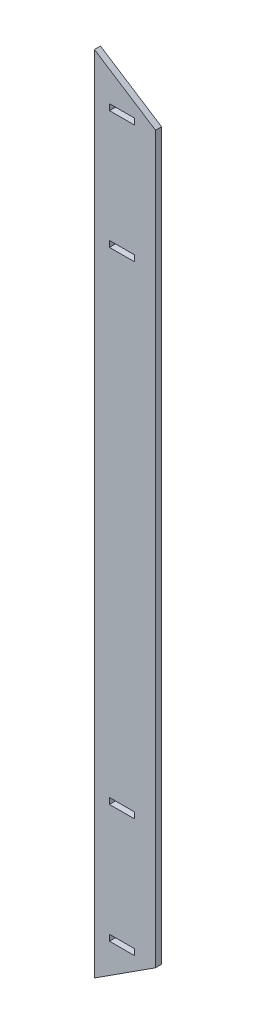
ISO-10303-21;
HEADER;
FILE_DESCRIPTION(('STEP AP214'),'2;1');
FILE_NAME('part.step','',(''),(''),'','','');
FILE_SCHEMA(('AUTOMOTIVE_DESIGN { 1 0 10303 214 1 1 1 1 }'));
ENDSEC;
DATA;
#1=APPLICATION_CONTEXT('core data for automotive mechanical design processes');
#2=APPLICATION_PROTOCOL_DEFINITION('international standard','automotive_design',2000,#1);
#3=PRODUCT_CONTEXT('',#1,'mechanical');
#4=PRODUCT('Part','Part','',(#3));
#5=PRODUCT_RELATED_PRODUCT_CATEGORY('part','',(#4));
#6=PRODUCT_DEFINITION_FORMATION('','',#4);
#7=PRODUCT_DEFINITION_CONTEXT('part definition',#1,'design');
#8=PRODUCT_DEFINITION('design','',#6,#7);
#9=PRODUCT_DEFINITION_SHAPE('','',#8);
#10=(LENGTH_UNIT() NAMED_UNIT(*) SI_UNIT(.MILLI.,.METRE.));
#11=(NAMED_UNIT(*) PLANE_ANGLE_UNIT() SI_UNIT($,.RADIAN.));
#12=(NAMED_UNIT(*) SI_UNIT($,.STERADIAN.) SOLID_ANGLE_UNIT());
#13=UNCERTAINTY_MEASURE_WITH_UNIT(LENGTH_MEASURE(1.E-05),#10,'distance_accuracy_value','');
#14=(GEOMETRIC_REPRESENTATION_CONTEXT(3) GLOBAL_UNCERTAINTY_ASSIGNED_CONTEXT((#13)) GLOBAL_UNIT_ASSIGNED_CONTEXT((#10,
#11,#12)) REPRESENTATION_CONTEXT('',''));
#15=CARTESIAN_POINT('',(0.,0.,0.));
#16=DIRECTION('',(0.,0.,1.));
#17=DIRECTION('',(1.,0.,0.));
#18=AXIS2_PLACEMENT_3D('',#15,#16,#17);
#19=CARTESIAN_POINT('',(0.,0.,1.524));
#20=DIRECTION('',(0.,0.,-1.));
#21=DIRECTION('',(-1.,0.,0.));
#22=AXIS2_PLACEMENT_3D('',#19,#20,#21);
#23=PLANE('',#22);
#24=DIRECTION('',(0.,-1.,0.));
#25=VECTOR('',#24,1.);
#26=CARTESIAN_POINT('',(5.31983445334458,-153.360857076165,1.524));
#27=LINE('',#26,#25);
#28=CARTESIAN_POINT('',(5.31983445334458,-151.836857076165,1.524));
#29=VERTEX_POINT('',#28);
#30=CARTESIAN_POINT('',(5.31983445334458,-153.360857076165,1.524));
#31=VERTEX_POINT('',#30);
#32=EDGE_CURVE('E209',#29,#31,#27,.T.);
#33=ORIENTED_EDGE('',*,*,#32,.F.);
#34=DIRECTION('',(-1.,0.,0.));
#35=VECTOR('',#34,1.);
#36=CARTESIAN_POINT('',(5.31983445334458,-151.836857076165,1.524));
#37=LINE('',#36,#35);
#38=CARTESIAN_POINT('',(11.6698344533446,-151.836857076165,1.524));
#39=VERTEX_POINT('',#38);
#40=EDGE_CURVE('E217',#39,#29,#37,.T.);
#41=ORIENTED_EDGE('',*,*,#40,.F.);
#42=DIRECTION('',(0.,1.,0.));
#43=VECTOR('',#42,1.);
#44=CARTESIAN_POINT('',(11.6698344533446,-153.360857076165,1.524));
#45=LINE('',#44,#43);
#46=CARTESIAN_POINT('',(11.6698344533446,-153.360857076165,1.524));
#47=VERTEX_POINT('',#46);
#48=EDGE_CURVE('E214',#47,#39,#45,.T.);
#49=ORIENTED_EDGE('',*,*,#48,.F.);
#50=DIRECTION('',(1.,0.,0.));
#51=VECTOR('',#50,1.);
#52=CARTESIAN_POINT('',(5.31983445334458,-153.360857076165,1.524));
#53=LINE('',#52,#51);
#54=EDGE_CURVE('E211',#31,#47,#53,.T.);
#55=ORIENTED_EDGE('',*,*,#54,.F.);
#56=EDGE_LOOP('',(#33,#41,#49,#55));
#57=FACE_BOUND('',#56,.T.);
#58=DIRECTION('',(0.,-1.,0.));
#59=VECTOR('',#58,1.);
#60=CARTESIAN_POINT('',(5.31983445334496,0.,1.524));
#61=LINE('',#60,#59);
#62=CARTESIAN_POINT('',(5.31983445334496,0.,1.524));
#63=VERTEX_POINT('',#62);
#64=CARTESIAN_POINT('',(5.31983445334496,-1.524,1.524));
#65=VERTEX_POINT('',#64);
#66=EDGE_CURVE('E271',#63,#65,#61,.T.);
#67=ORIENTED_EDGE('',*,*,#66,.F.);
#68=DIRECTION('',(-1.,0.,0.));
#69=VECTOR('',#68,1.);
#70=CARTESIAN_POINT('',(5.31983445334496,0.,1.524));
#71=LINE('',#70,#69);
#72=CARTESIAN_POINT('',(11.669834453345,0.,1.524));
#73=VERTEX_POINT('',#72);
#74=EDGE_CURVE('E279',#73,#63,#71,.T.);
#75=ORIENTED_EDGE('',*,*,#74,.F.);
#76=DIRECTION('',(0.,1.,0.));
#77=VECTOR('',#76,1.);
#78=CARTESIAN_POINT('',(11.669834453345,0.,1.524));
#79=LINE('',#78,#77);
#80=CARTESIAN_POINT('',(11.669834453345,-1.524,1.524));
#81=VERTEX_POINT('',#80);
#82=EDGE_CURVE('E276',#81,#73,#79,.T.);
#83=ORIENTED_EDGE('',*,*,#82,.F.);
#84=DIRECTION('',(1.,0.,0.));
#85=VECTOR('',#84,1.);
#86=CARTESIAN_POINT('',(5.31983445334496,-1.524,1.524));
#87=LINE('',#86,#85);
#88=EDGE_CURVE('E273',#65,#81,#87,.T.);
#89=ORIENTED_EDGE('',*,*,#88,.F.);
#90=EDGE_LOOP('',(#67,#75,#83,#89));
#91=FACE_BOUND('',#90,.T.);
#92=DIRECTION('',(-0.840540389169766,0.541748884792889,0.));
#93=VECTOR('',#92,1.);
#94=CARTESIAN_POINT('',(16.9701384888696,0.,1.524));
#95=LINE('',#94,#93);
#96=CARTESIAN_POINT('',(16.9701384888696,0.,1.524));
#97=VERTEX_POINT('',#96);
#98=CARTESIAN_POINT('',(1.52399999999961,9.9554148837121,1.524));
#99=VERTEX_POINT('',#98);
#100=EDGE_CURVE('E302',#97,#99,#95,.T.);
#101=ORIENTED_EDGE('',*,*,#100,.T.);
#102=DIRECTION('',(0.,-1.,0.));
#103=VECTOR('',#102,1.);
#104=CARTESIAN_POINT('',(1.52399999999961,9.9554148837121,1.524));
#105=LINE('',#104,#103);
#106=CARTESIAN_POINT('',(1.52399999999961,-193.244585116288,1.524));
#107=VERTEX_POINT('',#106);
#108=EDGE_CURVE('E305',#99,#107,#105,.T.);
#109=ORIENTED_EDGE('',*,*,#108,.T.);
#110=DIRECTION('',(0.840540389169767,0.541748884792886,0.));
#111=VECTOR('',#110,1.);
#112=CARTESIAN_POINT('',(1.52399999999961,-193.244585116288,1.524));
#113=LINE('',#112,#111);
#114=CARTESIAN_POINT('',(16.9701384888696,-183.289170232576,1.524));
#115=VERTEX_POINT('',#114);
#116=EDGE_CURVE('E308',#107,#115,#113,.T.);
#117=ORIENTED_EDGE('',*,*,#116,.T.);
#118=DIRECTION('',(0.,1.,0.));
#119=VECTOR('',#118,1.);
#120=CARTESIAN_POINT('',(16.9701384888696,-183.289170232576,1.524));
#121=LINE('',#120,#119);
#122=EDGE_CURVE('E310',#115,#97,#121,.T.);
#123=ORIENTED_EDGE('',*,*,#122,.T.);
#124=EDGE_LOOP('',(#101,#109,#117,#123));
#125=FACE_BOUND('',#124,.T.);
#126=DIRECTION('',(0.,-1.,0.));
#127=VECTOR('',#126,1.);
#128=CARTESIAN_POINT('',(5.31983445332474,-29.9283131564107,1.524));
#129=LINE('',#128,#127);
#130=CARTESIAN_POINT('',(5.31983445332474,-29.9283131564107,1.524));
#131=VERTEX_POINT('',#130);
#132=CARTESIAN_POINT('',(5.31983445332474,-31.4523131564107,1.524));
#133=VERTEX_POINT('',#132);
#134=EDGE_CURVE('E240',#131,#133,#129,.T.);
#135=ORIENTED_EDGE('',*,*,#134,.F.);
#136=DIRECTION('',(-1.,0.,0.));
#137=VECTOR('',#136,1.);
#138=CARTESIAN_POINT('',(5.31983445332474,-29.9283131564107,1.524));
#139=LINE('',#138,#137);
#140=CARTESIAN_POINT('',(11.6698344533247,-29.9283131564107,1.524));
#141=VERTEX_POINT('',#140);
#142=EDGE_CURVE('E248',#141,#131,#139,.T.);
#143=ORIENTED_EDGE('',*,*,#142,.F.);
#144=DIRECTION('',(0.,1.,0.));
#145=VECTOR('',#144,1.);
#146=CARTESIAN_POINT('',(11.6698344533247,-29.9283131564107,1.524));
#147=LINE('',#146,#145);
#148=CARTESIAN_POINT('',(11.6698344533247,-31.4523131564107,1.524));
#149=VERTEX_POINT('',#148);
#150=EDGE_CURVE('E245',#149,#141,#147,.T.);
#151=ORIENTED_EDGE('',*,*,#150,.F.);
#152=DIRECTION('',(1.,0.,0.));
#153=VECTOR('',#152,1.);
#154=CARTESIAN_POINT('',(5.31983445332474,-31.4523131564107,1.524));
#155=LINE('',#154,#153);
#156=EDGE_CURVE('E242',#133,#149,#155,.T.);
#157=ORIENTED_EDGE('',*,*,#156,.F.);
#158=EDGE_LOOP('',(#135,#143,#151,#157));
#159=FACE_BOUND('',#158,.T.);
#160=DIRECTION('',(0.,-1.,0.));
#161=VECTOR('',#160,1.);
#162=CARTESIAN_POINT('',(5.31983445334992,-183.289170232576,1.524));
#163=LINE('',#162,#161);
#164=CARTESIAN_POINT('',(5.31983445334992,-181.765170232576,1.524));
#165=VERTEX_POINT('',#164);
#166=CARTESIAN_POINT('',(5.31983445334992,-183.289170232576,1.524));
#167=VERTEX_POINT('',#166);
#168=EDGE_CURVE('E173',#165,#167,#163,.T.);
#169=ORIENTED_EDGE('',*,*,#168,.F.);
#170=DIRECTION('',(-1.,0.,0.));
#171=VECTOR('',#170,1.);
#172=CARTESIAN_POINT('',(5.31983445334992,-181.765170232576,1.524));
#173=LINE('',#172,#171);
#174=CARTESIAN_POINT('',(11.6698344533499,-181.765170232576,1.524));
#175=VERTEX_POINT('',#174);
#176=EDGE_CURVE('E195',#175,#165,#173,.T.);
#177=ORIENTED_EDGE('',*,*,#176,.F.);
#178=DIRECTION('',(0.,1.,0.));
#179=VECTOR('',#178,1.);
#180=CARTESIAN_POINT('',(11.6698344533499,-183.289170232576,1.524));
#181=LINE('',#180,#179);
#182=CARTESIAN_POINT('',(11.6698344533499,-183.289170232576,1.524));
#183=VERTEX_POINT('',#182);
#184=EDGE_CURVE('E193',#183,#175,#181,.T.);
#185=ORIENTED_EDGE('',*,*,#184,.F.);
#186=DIRECTION('',(1.,0.,0.));
#187=VECTOR('',#186,1.);
#188=CARTESIAN_POINT('',(5.31983445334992,-183.289170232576,1.524));
#189=LINE('',#188,#187);
#190=EDGE_CURVE('E181',#167,#183,#189,.T.);
#191=ORIENTED_EDGE('',*,*,#190,.F.);
#192=EDGE_LOOP('',(#169,#177,#185,#191));
#193=FACE_BOUND('',#192,.T.);
#194=ADVANCED_FACE('F36',(#57,#91,#125,#159,#193),#23,.F.);
#195=CARTESIAN_POINT('',(0.,0.,0.));
#196=DIRECTION('',(0.,0.,-1.));
#197=DIRECTION('',(-1.,0.,0.));
#198=AXIS2_PLACEMENT_3D('',#195,#196,#197);
#199=PLANE('',#198);
#200=DIRECTION('',(-1.,0.,0.));
#201=VECTOR('',#200,1.);
#202=CARTESIAN_POINT('',(5.31983445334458,-151.836857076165,0.));
#203=LINE('',#202,#201);
#204=CARTESIAN_POINT('',(11.6698344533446,-151.836857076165,0.));
#205=VERTEX_POINT('',#204);
#206=CARTESIAN_POINT('',(5.31983445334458,-151.836857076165,0.));
#207=VERTEX_POINT('',#206);
#208=EDGE_CURVE('E212',#205,#207,#203,.T.);
#209=ORIENTED_EDGE('',*,*,#208,.T.);
#210=DIRECTION('',(0.,-1.,0.));
#211=VECTOR('',#210,1.);
#212=CARTESIAN_POINT('',(5.31983445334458,-153.360857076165,0.));
#213=LINE('',#212,#211);
#214=CARTESIAN_POINT('',(5.31983445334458,-153.360857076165,0.));
#215=VERTEX_POINT('',#214);
#216=EDGE_CURVE('E189',#207,#215,#213,.T.);
#217=ORIENTED_EDGE('',*,*,#216,.T.);
#218=DIRECTION('',(1.,0.,0.));
#219=VECTOR('',#218,1.);
#220=CARTESIAN_POINT('',(5.31983445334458,-153.360857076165,0.));
#221=LINE('',#220,#219);
#222=CARTESIAN_POINT('',(11.6698344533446,-153.360857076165,0.));
#223=VERTEX_POINT('',#222);
#224=EDGE_CURVE('E222',#215,#223,#221,.T.);
#225=ORIENTED_EDGE('',*,*,#224,.T.);
#226=DIRECTION('',(0.,1.,0.));
#227=VECTOR('',#226,1.);
#228=CARTESIAN_POINT('',(11.6698344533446,-153.360857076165,0.));
#229=LINE('',#228,#227);
#230=EDGE_CURVE('E225',#223,#205,#229,.T.);
#231=ORIENTED_EDGE('',*,*,#230,.T.);
#232=EDGE_LOOP('',(#209,#217,#225,#231));
#233=FACE_BOUND('',#232,.T.);
#234=DIRECTION('',(-1.,0.,0.));
#235=VECTOR('',#234,1.);
#236=CARTESIAN_POINT('',(5.31983445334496,0.,0.));
#237=LINE('',#236,#235);
#238=CARTESIAN_POINT('',(11.669834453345,0.,0.));
#239=VERTEX_POINT('',#238);
#240=CARTESIAN_POINT('',(5.31983445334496,0.,0.));
#241=VERTEX_POINT('',#240);
#242=EDGE_CURVE('E274',#239,#241,#237,.T.);
#243=ORIENTED_EDGE('',*,*,#242,.T.);
#244=DIRECTION('',(0.,-1.,0.));
#245=VECTOR('',#244,1.);
#246=CARTESIAN_POINT('',(5.31983445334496,0.,0.));
#247=LINE('',#246,#245);
#248=CARTESIAN_POINT('',(5.31983445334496,-1.524,0.));
#249=VERTEX_POINT('',#248);
#250=EDGE_CURVE('E270',#241,#249,#247,.T.);
#251=ORIENTED_EDGE('',*,*,#250,.T.);
#252=DIRECTION('',(1.,0.,0.));
#253=VECTOR('',#252,1.);
#254=CARTESIAN_POINT('',(5.31983445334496,-1.524,0.));
#255=LINE('',#254,#253);
#256=CARTESIAN_POINT('',(11.669834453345,-1.524,0.));
#257=VERTEX_POINT('',#256);
#258=EDGE_CURVE('E284',#249,#257,#255,.T.);
#259=ORIENTED_EDGE('',*,*,#258,.T.);
#260=DIRECTION('',(0.,1.,0.));
#261=VECTOR('',#260,1.);
#262=CARTESIAN_POINT('',(11.669834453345,0.,0.));
#263=LINE('',#262,#261);
#264=EDGE_CURVE('E287',#257,#239,#263,.T.);
#265=ORIENTED_EDGE('',*,*,#264,.T.);
#266=EDGE_LOOP('',(#243,#251,#259,#265));
#267=FACE_BOUND('',#266,.T.);
#268=DIRECTION('',(-0.840540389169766,0.541748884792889,0.));
#269=VECTOR('',#268,1.);
#270=CARTESIAN_POINT('',(16.9701384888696,0.,0.));
#271=LINE('',#270,#269);
#272=CARTESIAN_POINT('',(16.9701384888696,0.,0.));
#273=VERTEX_POINT('',#272);
#274=CARTESIAN_POINT('',(1.52399999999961,9.9554148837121,0.));
#275=VERTEX_POINT('',#274);
#276=EDGE_CURVE('E301',#273,#275,#271,.T.);
#277=ORIENTED_EDGE('',*,*,#276,.F.);
#278=DIRECTION('',(0.,1.,0.));
#279=VECTOR('',#278,1.);
#280=CARTESIAN_POINT('',(16.9701384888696,-183.289170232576,0.));
#281=LINE('',#280,#279);
#282=CARTESIAN_POINT('',(16.9701384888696,-183.289170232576,0.));
#283=VERTEX_POINT('',#282);
#284=EDGE_CURVE('E306',#283,#273,#281,.T.);
#285=ORIENTED_EDGE('',*,*,#284,.F.);
#286=DIRECTION('',(0.840540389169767,0.541748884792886,0.));
#287=VECTOR('',#286,1.);
#288=CARTESIAN_POINT('',(1.52399999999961,-193.244585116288,0.));
#289=LINE('',#288,#287);
#290=CARTESIAN_POINT('',(1.52399999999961,-193.244585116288,0.));
#291=VERTEX_POINT('',#290);
#292=EDGE_CURVE('E317',#291,#283,#289,.T.);
#293=ORIENTED_EDGE('',*,*,#292,.F.);
#294=DIRECTION('',(0.,-1.,0.));
#295=VECTOR('',#294,1.);
#296=CARTESIAN_POINT('',(1.52399999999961,9.9554148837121,0.));
#297=LINE('',#296,#295);
#298=EDGE_CURVE('E315',#275,#291,#297,.T.);
#299=ORIENTED_EDGE('',*,*,#298,.F.);
#300=EDGE_LOOP('',(#277,#285,#293,#299));
#301=FACE_BOUND('',#300,.T.);
#302=DIRECTION('',(-1.,0.,0.));
#303=VECTOR('',#302,1.);
#304=CARTESIAN_POINT('',(5.31983445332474,-29.9283131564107,0.));
#305=LINE('',#304,#303);
#306=CARTESIAN_POINT('',(11.6698344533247,-29.9283131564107,0.));
#307=VERTEX_POINT('',#306);
#308=CARTESIAN_POINT('',(5.31983445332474,-29.9283131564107,0.));
#309=VERTEX_POINT('',#308);
#310=EDGE_CURVE('E243',#307,#309,#305,.T.);
#311=ORIENTED_EDGE('',*,*,#310,.T.);
#312=DIRECTION('',(0.,-1.,0.));
#313=VECTOR('',#312,1.);
#314=CARTESIAN_POINT('',(5.31983445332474,-29.9283131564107,0.));
#315=LINE('',#314,#313);
#316=CARTESIAN_POINT('',(5.31983445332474,-31.4523131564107,0.));
#317=VERTEX_POINT('',#316);
#318=EDGE_CURVE('E239',#309,#317,#315,.T.);
#319=ORIENTED_EDGE('',*,*,#318,.T.);
#320=DIRECTION('',(1.,0.,0.));
#321=VECTOR('',#320,1.);
#322=CARTESIAN_POINT('',(5.31983445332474,-31.4523131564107,0.));
#323=LINE('',#322,#321);
#324=CARTESIAN_POINT('',(11.6698344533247,-31.4523131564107,0.));
#325=VERTEX_POINT('',#324);
#326=EDGE_CURVE('E253',#317,#325,#323,.T.);
#327=ORIENTED_EDGE('',*,*,#326,.T.);
#328=DIRECTION('',(0.,1.,0.));
#329=VECTOR('',#328,1.);
#330=CARTESIAN_POINT('',(11.6698344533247,-29.9283131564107,0.));
#331=LINE('',#330,#329);
#332=EDGE_CURVE('E256',#325,#307,#331,.T.);
#333=ORIENTED_EDGE('',*,*,#332,.T.);
#334=EDGE_LOOP('',(#311,#319,#327,#333));
#335=FACE_BOUND('',#334,.T.);
#336=DIRECTION('',(-1.,0.,0.));
#337=VECTOR('',#336,1.);
#338=CARTESIAN_POINT('',(5.31983445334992,-181.765170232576,0.));
#339=LINE('',#338,#337);
#340=CARTESIAN_POINT('',(11.6698344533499,-181.765170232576,0.));
#341=VERTEX_POINT('',#340);
#342=CARTESIAN_POINT('',(5.31983445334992,-181.765170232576,0.));
#343=VERTEX_POINT('',#342);
#344=EDGE_CURVE('E182',#341,#343,#339,.T.);
#345=ORIENTED_EDGE('',*,*,#344,.T.);
#346=DIRECTION('',(0.,-1.,0.));
#347=VECTOR('',#346,1.);
#348=CARTESIAN_POINT('',(5.31983445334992,-183.289170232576,0.));
#349=LINE('',#348,#347);
#350=CARTESIAN_POINT('',(5.31983445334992,-183.289170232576,0.));
#351=VERTEX_POINT('',#350);
#352=EDGE_CURVE('E59',#343,#351,#349,.T.);
#353=ORIENTED_EDGE('',*,*,#352,.T.);
#354=DIRECTION('',(1.,0.,0.));
#355=VECTOR('',#354,1.);
#356=CARTESIAN_POINT('',(5.31983445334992,-183.289170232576,0.));
#357=LINE('',#356,#355);
#358=CARTESIAN_POINT('',(11.6698344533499,-183.289170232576,0.));
#359=VERTEX_POINT('',#358);
#360=EDGE_CURVE('E188',#351,#359,#357,.T.);
#361=ORIENTED_EDGE('',*,*,#360,.T.);
#362=DIRECTION('',(0.,1.,0.));
#363=VECTOR('',#362,1.);
#364=CARTESIAN_POINT('',(11.6698344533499,-183.289170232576,0.));
#365=LINE('',#364,#363);
#366=EDGE_CURVE('E201',#359,#341,#365,.T.);
#367=ORIENTED_EDGE('',*,*,#366,.T.);
#368=EDGE_LOOP('',(#345,#353,#361,#367));
#369=FACE_BOUND('',#368,.T.);
#370=ADVANCED_FACE('F335',(#233,#267,#301,#335,#369),#199,.T.);
#371=CARTESIAN_POINT('',(16.9701384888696,0.,1.524));
#372=DIRECTION('',(-0.541748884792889,-0.840540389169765,0.));
#373=DIRECTION('',(0.840540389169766,-0.541748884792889,0.));
#374=AXIS2_PLACEMENT_3D('',#371,#372,#373);
#375=PLANE('',#374);
#376=ORIENTED_EDGE('',*,*,#276,.T.);
#377=DIRECTION('',(0.,0.,-1.));
#378=VECTOR('',#377,1.);
#379=CARTESIAN_POINT('',(1.52399999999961,9.9554148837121,1.524));
#380=LINE('',#379,#378);
#381=EDGE_CURVE('E11',#99,#275,#380,.T.);
#382=ORIENTED_EDGE('',*,*,#381,.F.);
#383=ORIENTED_EDGE('',*,*,#100,.F.);
#384=DIRECTION('',(0.,0.,-1.));
#385=VECTOR('',#384,1.);
#386=CARTESIAN_POINT('',(16.9701384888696,0.,1.524));
#387=LINE('',#386,#385);
#388=EDGE_CURVE('E312',#97,#273,#387,.T.);
#389=ORIENTED_EDGE('',*,*,#388,.T.);
#390=EDGE_LOOP('',(#376,#382,#383,#389));
#391=FACE_BOUND('',#390,.T.);
#392=ADVANCED_FACE('F38',(#391),#375,.F.);
#393=CARTESIAN_POINT('',(1.52399999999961,9.9554148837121,1.524));
#394=DIRECTION('',(1.,0.,0.));
#395=DIRECTION('',(0.,1.,0.));
#396=AXIS2_PLACEMENT_3D('',#393,#394,#395);
#397=PLANE('',#396);
#398=ORIENTED_EDGE('',*,*,#298,.T.);
#399=DIRECTION('',(0.,0.,-1.));
#400=VECTOR('',#399,1.);
#401=CARTESIAN_POINT('',(1.52399999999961,-193.244585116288,1.524));
#402=LINE('',#401,#400);
#403=EDGE_CURVE('E44',#107,#291,#402,.T.);
#404=ORIENTED_EDGE('',*,*,#403,.F.);
#405=ORIENTED_EDGE('',*,*,#108,.F.);
#406=ORIENTED_EDGE('',*,*,#381,.T.);
#407=EDGE_LOOP('',(#398,#404,#405,#406));
#408=FACE_BOUND('',#407,.T.);
#409=ADVANCED_FACE('F346',(#408),#397,.F.);
#410=CARTESIAN_POINT('',(1.52399999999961,-193.244585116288,1.524));
#411=DIRECTION('',(-0.541748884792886,0.840540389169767,0.));
#412=DIRECTION('',(-0.840540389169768,-0.541748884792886,0.));
#413=AXIS2_PLACEMENT_3D('',#410,#411,#412);
#414=PLANE('',#413);
#415=ORIENTED_EDGE('',*,*,#292,.T.);
#416=DIRECTION('',(0.,0.,-1.));
#417=VECTOR('',#416,1.);
#418=CARTESIAN_POINT('',(16.9701384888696,-183.289170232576,1.524));
#419=LINE('',#418,#417);
#420=EDGE_CURVE('E322',#115,#283,#419,.T.);
#421=ORIENTED_EDGE('',*,*,#420,.F.);
#422=ORIENTED_EDGE('',*,*,#116,.F.);
#423=ORIENTED_EDGE('',*,*,#403,.T.);
#424=EDGE_LOOP('',(#415,#421,#422,#423));
#425=FACE_BOUND('',#424,.T.);
#426=ADVANCED_FACE('F329',(#425),#414,.F.);
#427=CARTESIAN_POINT('',(16.9701384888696,-183.289170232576,1.524));
#428=DIRECTION('',(-1.,0.,0.));
#429=DIRECTION('',(0.,0.,1.));
#430=AXIS2_PLACEMENT_3D('',#427,#428,#429);
#431=PLANE('',#430);
#432=ORIENTED_EDGE('',*,*,#284,.T.);
#433=ORIENTED_EDGE('',*,*,#388,.F.);
#434=ORIENTED_EDGE('',*,*,#122,.F.);
#435=ORIENTED_EDGE('',*,*,#420,.T.);
#436=EDGE_LOOP('',(#432,#433,#434,#435));
#437=FACE_BOUND('',#436,.T.);
#438=ADVANCED_FACE('F339',(#437),#431,.F.);
#439=CARTESIAN_POINT('',(5.31983445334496,0.,1.524));
#440=DIRECTION('',(1.,0.,0.));
#441=DIRECTION('',(0.,0.,-1.));
#442=AXIS2_PLACEMENT_3D('',#439,#440,#441);
#443=PLANE('',#442);
#444=ORIENTED_EDGE('',*,*,#250,.F.);
#445=DIRECTION('',(0.,0.,-1.));
#446=VECTOR('',#445,1.);
#447=CARTESIAN_POINT('',(5.31983445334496,0.,1.524));
#448=LINE('',#447,#446);
#449=EDGE_CURVE('E281',#63,#241,#448,.T.);
#450=ORIENTED_EDGE('',*,*,#449,.F.);
#451=ORIENTED_EDGE('',*,*,#66,.T.);
#452=DIRECTION('',(0.,0.,-1.));
#453=VECTOR('',#452,1.);
#454=CARTESIAN_POINT('',(5.31983445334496,-1.524,1.524));
#455=LINE('',#454,#453);
#456=EDGE_CURVE('E298',#65,#249,#455,.T.);
#457=ORIENTED_EDGE('',*,*,#456,.T.);
#458=EDGE_LOOP('',(#444,#450,#451,#457));
#459=FACE_BOUND('',#458,.T.);
#460=ADVANCED_FACE('F364',(#459),#443,.T.);
#461=CARTESIAN_POINT('',(5.31983445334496,-1.524,1.524));
#462=DIRECTION('',(0.,1.,0.));
#463=DIRECTION('',(0.,0.,1.));
#464=AXIS2_PLACEMENT_3D('',#461,#462,#463);
#465=PLANE('',#464);
#466=ORIENTED_EDGE('',*,*,#258,.F.);
#467=ORIENTED_EDGE('',*,*,#456,.F.);
#468=ORIENTED_EDGE('',*,*,#88,.T.);
#469=DIRECTION('',(0.,0.,-1.));
#470=VECTOR('',#469,1.);
#471=CARTESIAN_POINT('',(11.669834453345,-1.524,1.524));
#472=LINE('',#471,#470);
#473=EDGE_CURVE('E296',#81,#257,#472,.T.);
#474=ORIENTED_EDGE('',*,*,#473,.T.);
#475=EDGE_LOOP('',(#466,#467,#468,#474));
#476=FACE_BOUND('',#475,.T.);
#477=ADVANCED_FACE('F371',(#476),#465,.T.);
#478=CARTESIAN_POINT('',(11.669834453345,0.,1.524));
#479=DIRECTION('',(-1.,0.,0.));
#480=DIRECTION('',(0.,0.,1.));
#481=AXIS2_PLACEMENT_3D('',#478,#479,#480);
#482=PLANE('',#481);
#483=ORIENTED_EDGE('',*,*,#264,.F.);
#484=ORIENTED_EDGE('',*,*,#473,.F.);
#485=ORIENTED_EDGE('',*,*,#82,.T.);
#486=DIRECTION('',(0.,0.,-1.));
#487=VECTOR('',#486,1.);
#488=CARTESIAN_POINT('',(11.669834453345,0.,1.524));
#489=LINE('',#488,#487);
#490=EDGE_CURVE('E294',#73,#239,#489,.T.);
#491=ORIENTED_EDGE('',*,*,#490,.T.);
#492=EDGE_LOOP('',(#483,#484,#485,#491));
#493=FACE_BOUND('',#492,.T.);
#494=ADVANCED_FACE('F376',(#493),#482,.T.);
#495=CARTESIAN_POINT('',(5.31983445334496,0.,1.524));
#496=DIRECTION('',(0.,-1.,0.));
#497=DIRECTION('',(0.,0.,-1.));
#498=AXIS2_PLACEMENT_3D('',#495,#496,#497);
#499=PLANE('',#498);
#500=ORIENTED_EDGE('',*,*,#242,.F.);
#501=ORIENTED_EDGE('',*,*,#490,.F.);
#502=ORIENTED_EDGE('',*,*,#74,.T.);
#503=ORIENTED_EDGE('',*,*,#449,.T.);
#504=EDGE_LOOP('',(#500,#501,#502,#503));
#505=FACE_BOUND('',#504,.T.);
#506=ADVANCED_FACE('F384',(#505),#499,.T.);
#507=CARTESIAN_POINT('',(5.31983445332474,-29.9283131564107,1.524));
#508=DIRECTION('',(1.,0.,0.));
#509=DIRECTION('',(0.,0.,-1.));
#510=AXIS2_PLACEMENT_3D('',#507,#508,#509);
#511=PLANE('',#510);
#512=ORIENTED_EDGE('',*,*,#318,.F.);
#513=DIRECTION('',(0.,0.,-1.));
#514=VECTOR('',#513,1.);
#515=CARTESIAN_POINT('',(5.31983445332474,-29.9283131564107,1.524));
#516=LINE('',#515,#514);
#517=EDGE_CURVE('E250',#131,#309,#516,.T.);
#518=ORIENTED_EDGE('',*,*,#517,.F.);
#519=ORIENTED_EDGE('',*,*,#134,.T.);
#520=DIRECTION('',(0.,0.,-1.));
#521=VECTOR('',#520,1.);
#522=CARTESIAN_POINT('',(5.31983445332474,-31.4523131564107,1.524));
#523=LINE('',#522,#521);
#524=EDGE_CURVE('E267',#133,#317,#523,.T.);
#525=ORIENTED_EDGE('',*,*,#524,.T.);
#526=EDGE_LOOP('',(#512,#518,#519,#525));
#527=FACE_BOUND('',#526,.T.);
#528=ADVANCED_FACE('F396',(#527),#511,.T.);
#529=CARTESIAN_POINT('',(5.31983445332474,-31.4523131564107,1.524));
#530=DIRECTION('',(0.,1.,0.));
#531=DIRECTION('',(0.,0.,1.));
#532=AXIS2_PLACEMENT_3D('',#529,#530,#531);
#533=PLANE('',#532);
#534=ORIENTED_EDGE('',*,*,#326,.F.);
#535=ORIENTED_EDGE('',*,*,#524,.F.);
#536=ORIENTED_EDGE('',*,*,#156,.T.);
#537=DIRECTION('',(0.,0.,-1.));
#538=VECTOR('',#537,1.);
#539=CARTESIAN_POINT('',(11.6698344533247,-31.4523131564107,1.524));
#540=LINE('',#539,#538);
#541=EDGE_CURVE('E265',#149,#325,#540,.T.);
#542=ORIENTED_EDGE('',*,*,#541,.T.);
#543=EDGE_LOOP('',(#534,#535,#536,#542));
#544=FACE_BOUND('',#543,.T.);
#545=ADVANCED_FACE('F401',(#544),#533,.T.);
#546=CARTESIAN_POINT('',(11.6698344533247,-29.9283131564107,1.524));
#547=DIRECTION('',(-1.,0.,0.));
#548=DIRECTION('',(0.,0.,1.));
#549=AXIS2_PLACEMENT_3D('',#546,#547,#548);
#550=PLANE('',#549);
#551=ORIENTED_EDGE('',*,*,#332,.F.);
#552=ORIENTED_EDGE('',*,*,#541,.F.);
#553=ORIENTED_EDGE('',*,*,#150,.T.);
#554=DIRECTION('',(0.,0.,-1.));
#555=VECTOR('',#554,1.);
#556=CARTESIAN_POINT('',(11.6698344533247,-29.9283131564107,1.524));
#557=LINE('',#556,#555);
#558=EDGE_CURVE('E263',#141,#307,#557,.T.);
#559=ORIENTED_EDGE('',*,*,#558,.T.);
#560=EDGE_LOOP('',(#551,#552,#553,#559));
#561=FACE_BOUND('',#560,.T.);
#562=ADVANCED_FACE('F405',(#561),#550,.T.);
#563=CARTESIAN_POINT('',(5.31983445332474,-29.9283131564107,1.524));
#564=DIRECTION('',(0.,-1.,0.));
#565=DIRECTION('',(0.,0.,-1.));
#566=AXIS2_PLACEMENT_3D('',#563,#564,#565);
#567=PLANE('',#566);
#568=ORIENTED_EDGE('',*,*,#310,.F.);
#569=ORIENTED_EDGE('',*,*,#558,.F.);
#570=ORIENTED_EDGE('',*,*,#142,.T.);
#571=ORIENTED_EDGE('',*,*,#517,.T.);
#572=EDGE_LOOP('',(#568,#569,#570,#571));
#573=FACE_BOUND('',#572,.T.);
#574=ADVANCED_FACE('F409',(#573),#567,.T.);
#575=CARTESIAN_POINT('',(5.31983445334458,-153.360857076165,1.524));
#576=DIRECTION('',(1.,0.,0.));
#577=DIRECTION('',(0.,0.,-1.));
#578=AXIS2_PLACEMENT_3D('',#575,#576,#577);
#579=PLANE('',#578);
#580=ORIENTED_EDGE('',*,*,#216,.F.);
#581=DIRECTION('',(0.,0.,-1.));
#582=VECTOR('',#581,1.);
#583=CARTESIAN_POINT('',(5.31983445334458,-151.836857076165,1.524));
#584=LINE('',#583,#582);
#585=EDGE_CURVE('E219',#29,#207,#584,.T.);
#586=ORIENTED_EDGE('',*,*,#585,.F.);
#587=ORIENTED_EDGE('',*,*,#32,.T.);
#588=DIRECTION('',(0.,0.,-1.));
#589=VECTOR('',#588,1.);
#590=CARTESIAN_POINT('',(5.31983445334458,-153.360857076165,1.524));
#591=LINE('',#590,#589);
#592=EDGE_CURVE('E236',#31,#215,#591,.T.);
#593=ORIENTED_EDGE('',*,*,#592,.T.);
#594=EDGE_LOOP('',(#580,#586,#587,#593));
#595=FACE_BOUND('',#594,.T.);
#596=ADVANCED_FACE('F413',(#595),#579,.T.);
#597=CARTESIAN_POINT('',(5.31983445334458,-153.360857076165,1.524));
#598=DIRECTION('',(0.,1.,0.));
#599=DIRECTION('',(0.,0.,1.));
#600=AXIS2_PLACEMENT_3D('',#597,#598,#599);
#601=PLANE('',#600);
#602=ORIENTED_EDGE('',*,*,#224,.F.);
#603=ORIENTED_EDGE('',*,*,#592,.F.);
#604=ORIENTED_EDGE('',*,*,#54,.T.);
#605=DIRECTION('',(0.,0.,-1.));
#606=VECTOR('',#605,1.);
#607=CARTESIAN_POINT('',(11.6698344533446,-153.360857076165,1.524));
#608=LINE('',#607,#606);
#609=EDGE_CURVE('E234',#47,#223,#608,.T.);
#610=ORIENTED_EDGE('',*,*,#609,.T.);
#611=EDGE_LOOP('',(#602,#603,#604,#610));
#612=FACE_BOUND('',#611,.T.);
#613=ADVANCED_FACE('F417',(#612),#601,.T.);
#614=CARTESIAN_POINT('',(11.6698344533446,-153.360857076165,1.524));
#615=DIRECTION('',(-1.,0.,0.));
#616=DIRECTION('',(0.,0.,1.));
#617=AXIS2_PLACEMENT_3D('',#614,#615,#616);
#618=PLANE('',#617);
#619=ORIENTED_EDGE('',*,*,#230,.F.);
#620=ORIENTED_EDGE('',*,*,#609,.F.);
#621=ORIENTED_EDGE('',*,*,#48,.T.);
#622=DIRECTION('',(0.,0.,-1.));
#623=VECTOR('',#622,1.);
#624=CARTESIAN_POINT('',(11.6698344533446,-151.836857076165,1.524));
#625=LINE('',#624,#623);
#626=EDGE_CURVE('E232',#39,#205,#625,.T.);
#627=ORIENTED_EDGE('',*,*,#626,.T.);
#628=EDGE_LOOP('',(#619,#620,#621,#627));
#629=FACE_BOUND('',#628,.T.);
#630=ADVANCED_FACE('F421',(#629),#618,.T.);
#631=CARTESIAN_POINT('',(5.31983445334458,-151.836857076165,1.524));
#632=DIRECTION('',(0.,-1.,0.));
#633=DIRECTION('',(0.,0.,-1.));
#634=AXIS2_PLACEMENT_3D('',#631,#632,#633);
#635=PLANE('',#634);
#636=ORIENTED_EDGE('',*,*,#208,.F.);
#637=ORIENTED_EDGE('',*,*,#626,.F.);
#638=ORIENTED_EDGE('',*,*,#40,.T.);
#639=ORIENTED_EDGE('',*,*,#585,.T.);
#640=EDGE_LOOP('',(#636,#637,#638,#639));
#641=FACE_BOUND('',#640,.T.);
#642=ADVANCED_FACE('F425',(#641),#635,.T.);
#643=CARTESIAN_POINT('',(5.31983445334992,-183.289170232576,1.524));
#644=DIRECTION('',(1.,0.,0.));
#645=DIRECTION('',(0.,0.,-1.));
#646=AXIS2_PLACEMENT_3D('',#643,#644,#645);
#647=PLANE('',#646);
#648=ORIENTED_EDGE('',*,*,#352,.F.);
#649=DIRECTION('',(0.,0.,-1.));
#650=VECTOR('',#649,1.);
#651=CARTESIAN_POINT('',(5.31983445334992,-181.765170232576,1.524));
#652=LINE('',#651,#650);
#653=EDGE_CURVE('E177',#165,#343,#652,.T.);
#654=ORIENTED_EDGE('',*,*,#653,.F.);
#655=ORIENTED_EDGE('',*,*,#168,.T.);
#656=DIRECTION('',(0.,0.,-1.));
#657=VECTOR('',#656,1.);
#658=CARTESIAN_POINT('',(5.31983445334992,-183.289170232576,1.524));
#659=LINE('',#658,#657);
#660=EDGE_CURVE('E176',#167,#351,#659,.T.);
#661=ORIENTED_EDGE('',*,*,#660,.T.);
#662=EDGE_LOOP('',(#648,#654,#655,#661));
#663=FACE_BOUND('',#662,.T.);
#664=ADVANCED_FACE('F175',(#663),#647,.T.);
#665=CARTESIAN_POINT('',(5.31983445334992,-183.289170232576,1.524));
#666=DIRECTION('',(0.,1.,0.));
#667=DIRECTION('',(0.,0.,1.));
#668=AXIS2_PLACEMENT_3D('',#665,#666,#667);
#669=PLANE('',#668);
#670=ORIENTED_EDGE('',*,*,#360,.F.);
#671=ORIENTED_EDGE('',*,*,#660,.F.);
#672=ORIENTED_EDGE('',*,*,#190,.T.);
#673=DIRECTION('',(0.,0.,-1.));
#674=VECTOR('',#673,1.);
#675=CARTESIAN_POINT('',(11.6698344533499,-183.289170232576,1.524));
#676=LINE('',#675,#674);
#677=EDGE_CURVE('E190',#183,#359,#676,.T.);
#678=ORIENTED_EDGE('',*,*,#677,.T.);
#679=EDGE_LOOP('',(#670,#671,#672,#678));
#680=FACE_BOUND('',#679,.T.);
#681=ADVANCED_FACE('F185',(#680),#669,.T.);
#682=CARTESIAN_POINT('',(11.6698344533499,-183.289170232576,1.524));
#683=DIRECTION('',(-1.,0.,0.));
#684=DIRECTION('',(0.,0.,1.));
#685=AXIS2_PLACEMENT_3D('',#682,#683,#684);
#686=PLANE('',#685);
#687=ORIENTED_EDGE('',*,*,#366,.F.);
#688=ORIENTED_EDGE('',*,*,#677,.F.);
#689=ORIENTED_EDGE('',*,*,#184,.T.);
#690=DIRECTION('',(0.,0.,-1.));
#691=VECTOR('',#690,1.);
#692=CARTESIAN_POINT('',(11.6698344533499,-181.765170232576,1.524));
#693=LINE('',#692,#691);
#694=EDGE_CURVE('E51',#175,#341,#693,.T.);
#695=ORIENTED_EDGE('',*,*,#694,.T.);
#696=EDGE_LOOP('',(#687,#688,#689,#695));
#697=FACE_BOUND('',#696,.T.);
#698=ADVANCED_FACE('F434',(#697),#686,.T.);
#699=CARTESIAN_POINT('',(5.31983445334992,-181.765170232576,1.524));
#700=DIRECTION('',(0.,-1.,0.));
#701=DIRECTION('',(0.,0.,-1.));
#702=AXIS2_PLACEMENT_3D('',#699,#700,#701);
#703=PLANE('',#702);
#704=ORIENTED_EDGE('',*,*,#344,.F.);
#705=ORIENTED_EDGE('',*,*,#694,.F.);
#706=ORIENTED_EDGE('',*,*,#176,.T.);
#707=ORIENTED_EDGE('',*,*,#653,.T.);
#708=EDGE_LOOP('',(#704,#705,#706,#707));
#709=FACE_BOUND('',#708,.T.);
#710=ADVANCED_FACE('F437',(#709),#703,.T.);
#711=CLOSED_SHELL('',(#194,#370,#392,#409,#426,#438,#460,#477,#494,#506,#528,#545,#562,#574,
#596,#613,#630,#642,#664,#681,#698,#710));
#712=MANIFOLD_SOLID_BREP('B2',#711);
#713=ADVANCED_BREP_SHAPE_REPRESENTATION('',(#18,#712),#14);
#714=SHAPE_DEFINITION_REPRESENTATION(#9,#713);
ENDSEC;
END-ISO-10303-21;
